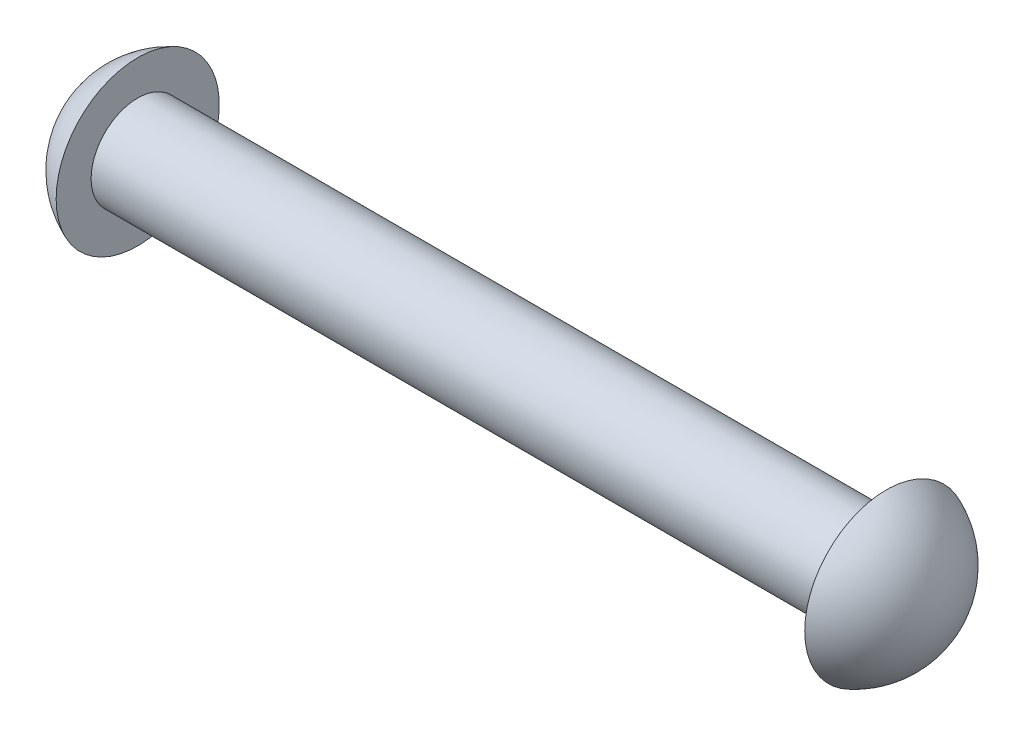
from build123d import *


with BuildPart() as part:
    # Sketch1 → Base-Revolve (revolve)
    with BuildSketch(Plane.XY, mode=Mode.PRIVATE) as base_revolve_sk:
        with BuildLine():
            Line((-17.26, 0), (0, 0))
            Line((0, 0), (0, 1))
            Line((0, 1), (-16.06, 1))
            Line((-16.06, 1), (-16.06, 1.75))
            ThreePointArc((-16.06, 1.75), (-16.927055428, 1.058123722), (-17.26, 0))
        make_face()
    revolve(base_revolve_sk.sketch.rotate(Axis((-39, 0, 0), (1, 0, 0)), 90), axis=Axis((-39, 0, 0), (1, 0, 0)))

    # Sketch3 → HeadTypeA (revolve)
    with BuildSketch(Plane.XY):
        with BuildLine():
            Line((0, 0), (1.2, 0))
            ThreePointArc((1.2, 0), (0.867055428, 1.058123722), (0, 1.75))
            Line((0, 1.75), (0, 0))
        make_face()
    revolve(axis=Axis((-49, 0, 0), (1, 0, 0)))


solid = part.part
